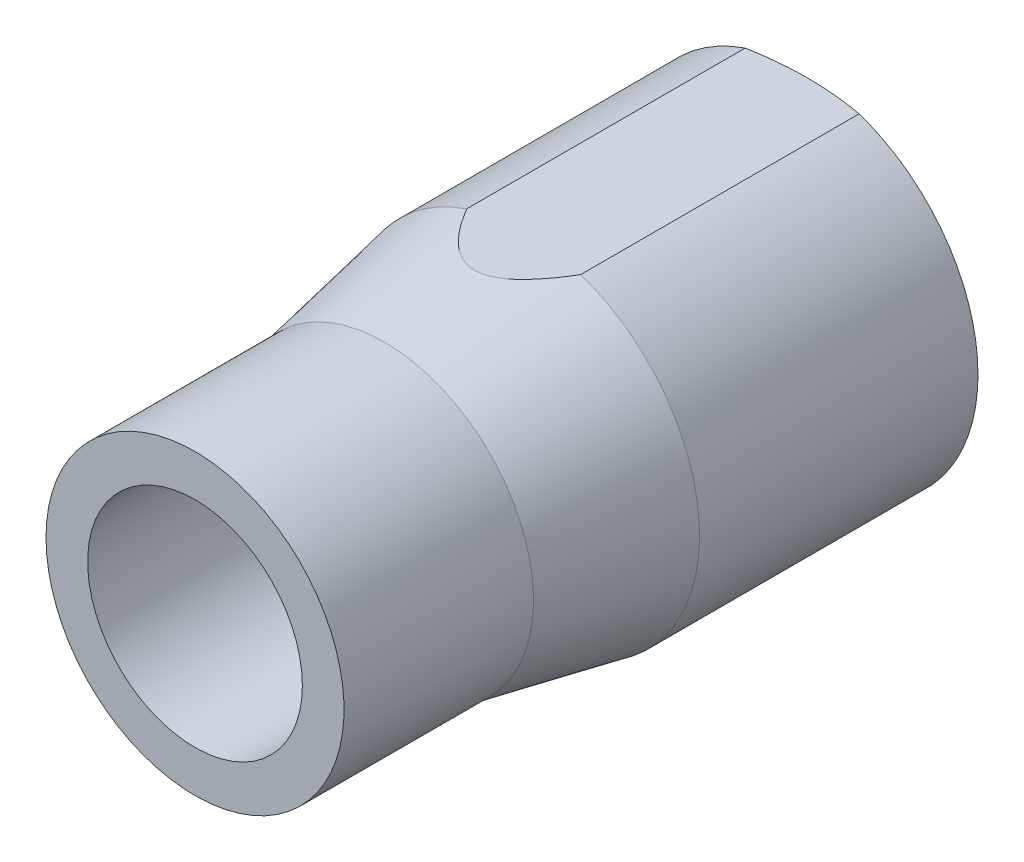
from build123d import *

# Parameters (mm, degrees)
SKETCH1_R           = 5.2451
BOSS_EXTRUDE1_DEPTH = 9.7155
CHAMFER1_SIZE       = 2.54
CHAMFER1_SIZE2      = 1.407944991
SKETCH2_R           = 4.445
SKETCH3_R           = 4.445
BOSS_EXTRUDE2_DEPTH = 5.6515
SKETCH4_R           = 2.069853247
CUT_EXTRUDE1_DEPTH  = 13.7795
SKETCH5_OUTSIDE_W   = 17.394
SKETCH5_OUTSIDE_H   = 17.394
SKETCH5_OUTSIDE_W_2 = 15.169695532
SKETCH5_OUTSIDE_H_2 = 9.924235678
CUT_EXTRUDE2_DEPTH  = 11.7475
SKETCH6_R           = 3.20242673
CUT_EXTRUDE3_DEPTH  = 8.1915


with BuildPart() as part:
    # Sketch1 → Boss-Extrude1 (new body)
    with BuildSketch(Plane.XY):
        with Locations(Location((0, 0, 0), (0, 0, 180))):
            Circle(SKETCH1_R)
    extrude(amount=BOSS_EXTRUDE1_DEPTH)

    # Chamfer1
    chamfer1_edges = [part.edges().sort_by_distance(p)[0] for p in [
        (5.2451, 0, 0),
    ]]
    chamfer1_side = [part.faces().sort_by_distance(p)[0] for p in [
        (0, 0, 0),
    ]]
    chamfer(chamfer1_edges, length=CHAMFER1_SIZE, length2=CHAMFER1_SIZE2, reference=chamfer1_side[0])

    # Sketch2 → section 0 of loft1
    with BuildSketch(Plane.XY.offset(13.8684), mode=Mode.PRIVATE) as loft1_s0:
        Circle(SKETCH2_R)
    # loft up to a face of the part (loft1)
    loft([loft1_s0.sketch, Face(Wire([part.edges().sort_by_distance((3.590518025, -3.823513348, 9.7155))[0]]))])

    # Sketch3 → Boss-Extrude2 (add)
    with BuildSketch(Plane.XY.offset(13.8684)):
        with Locations(Location((0, 0, 0), (0, 0, 180))):
            Circle(SKETCH3_R)
    extrude(amount=BOSS_EXTRUDE2_DEPTH)

    # Sketch4 → Cut-Extrude1 (cut)
    with BuildSketch(Plane(origin=(0, 0, 0), x_dir=(-1, 0, 0), z_dir=(0, 0, -1))):
        Circle(SKETCH4_R)
    extrude(amount=-CUT_EXTRUDE1_DEPTH, mode=Mode.SUBTRACT)

    # Sketch5 outside → Cut-Extrude2 (cut)
    with BuildSketch(Plane(origin=(0, 0, 0), x_dir=(-1, 0, 0), z_dir=(0, 0, -1))):
        Rectangle(SKETCH5_OUTSIDE_W, SKETCH5_OUTSIDE_H)
        with Locations((-0.203425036, 0)):
            Rectangle(SKETCH5_OUTSIDE_W_2, SKETCH5_OUTSIDE_H_2, mode=Mode.SUBTRACT)
    extrude(amount=-CUT_EXTRUDE2_DEPTH, mode=Mode.SUBTRACT)

    # Sketch6 → Cut-Extrude3 (cut)
    with BuildSketch(Plane.XY.offset(19.5199)):
        Circle(SKETCH6_R)
    extrude(amount=-CUT_EXTRUDE3_DEPTH, mode=Mode.SUBTRACT)


solid = part.part
